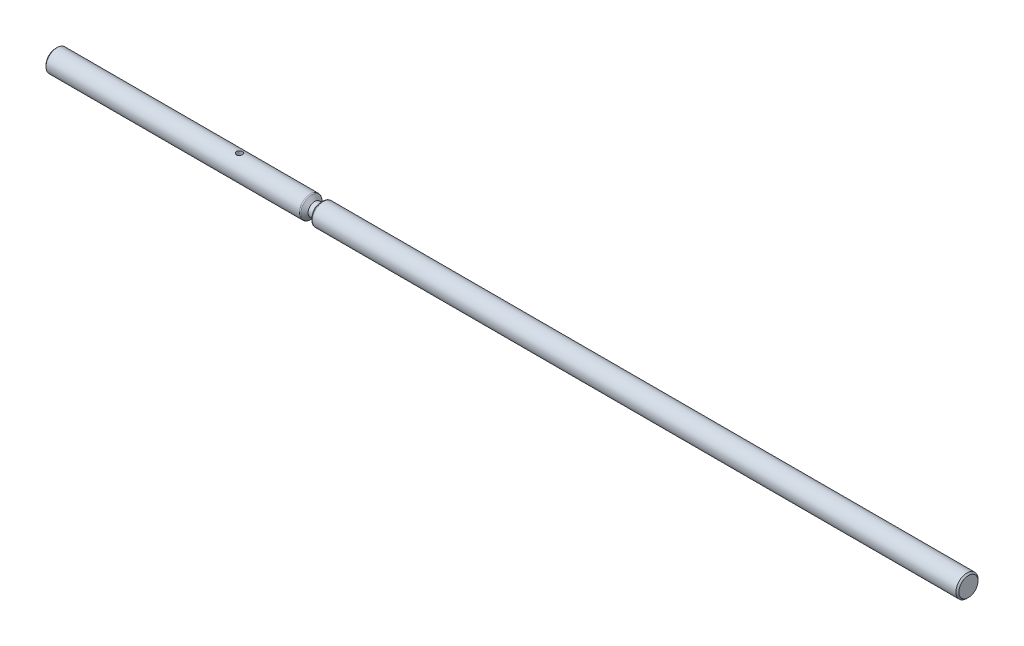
from build123d import *

# Parameters (mm, degrees)
ENL_V_MAT_EXTRU_1_DEPTH      = 621.090719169
ENL_V_MAT_EXTRU_1_DEPTH_BACK = 621.090719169
ESQUISSE2_R                  = 2
CONG_1_R                     = 1


with BuildPart() as part:
    # Esquisse1 → Base-R_volution (revolve)
    with BuildSketch(Plane.XY, mode=Mode.PRIVATE) as base_r_volution_sk:
        Polygon((0, 0), (0, 6.5), (1, 7.5), (173.5, 7.5), (176, 4.5), (179, 4.5), (181.5, 7.5), (619, 7.5), (620, 6.5), (620, 0), align=None)
    revolve(base_r_volution_sk.sketch.rotate(Axis((0, 0, 0), (1, 0, 0)), 90), axis=Axis((0, 0, 0), (1, 0, 0)))

    # Esquisse2 → Enl_v. mat.-Extru.1 (cut, two sides: drawn at the far end of the back side and taken through both)
    with BuildSketch(Plane(origin=(0, 0, 0), x_dir=(1, 0, 0), z_dir=(0, 1, 0)).offset(-ENL_V_MAT_EXTRU_1_DEPTH_BACK)):
        with Locations(Location((125, 0, 0), (0, 0, 270))):
            Circle(ESQUISSE2_R)
    extrude(amount=ENL_V_MAT_EXTRU_1_DEPTH + ENL_V_MAT_EXTRU_1_DEPTH_BACK, mode=Mode.SUBTRACT)

    # Cong_1
    cong_1_edges = [part.edges().sort_by_distance(p)[0] for p in [
        (181.5, 0, -7.5),
        (173.5, 0, -7.5),
    ]]
    fillet(cong_1_edges, radius=CONG_1_R)


solid = part.part
